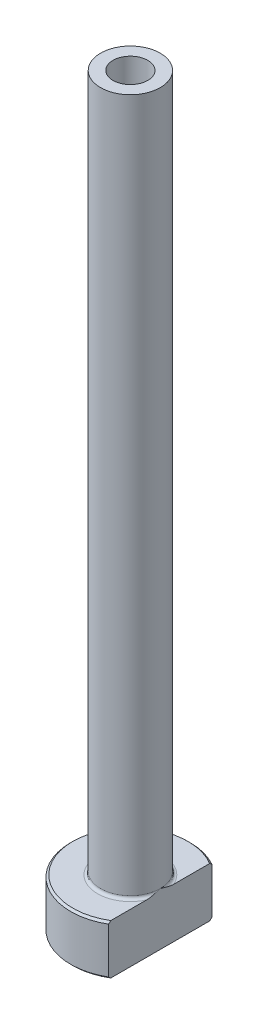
ISO-10303-21;
HEADER;
FILE_DESCRIPTION(('STEP AP214'),'2;1');
FILE_NAME('part.step','',(''),(''),'','','');
FILE_SCHEMA(('AUTOMOTIVE_DESIGN { 1 0 10303 214 1 1 1 1 }'));
ENDSEC;
DATA;
#1=APPLICATION_CONTEXT('core data for automotive mechanical design processes');
#2=APPLICATION_PROTOCOL_DEFINITION('international standard','automotive_design',2000,#1);
#3=PRODUCT_CONTEXT('',#1,'mechanical');
#4=PRODUCT('Part','Part','',(#3));
#5=PRODUCT_RELATED_PRODUCT_CATEGORY('part','',(#4));
#6=PRODUCT_DEFINITION_FORMATION('','',#4);
#7=PRODUCT_DEFINITION_CONTEXT('part definition',#1,'design');
#8=PRODUCT_DEFINITION('design','',#6,#7);
#9=PRODUCT_DEFINITION_SHAPE('','',#8);
#10=(LENGTH_UNIT() NAMED_UNIT(*) SI_UNIT(.MILLI.,.METRE.));
#11=(NAMED_UNIT(*) PLANE_ANGLE_UNIT() SI_UNIT($,.RADIAN.));
#12=(NAMED_UNIT(*) SI_UNIT($,.STERADIAN.) SOLID_ANGLE_UNIT());
#13=UNCERTAINTY_MEASURE_WITH_UNIT(LENGTH_MEASURE(1.E-05),#10,'distance_accuracy_value','');
#14=(GEOMETRIC_REPRESENTATION_CONTEXT(3) GLOBAL_UNCERTAINTY_ASSIGNED_CONTEXT((#13)) GLOBAL_UNIT_ASSIGNED_CONTEXT((#10,
#11,#12)) REPRESENTATION_CONTEXT('',''));
#15=CARTESIAN_POINT('',(0.,0.,0.));
#16=DIRECTION('',(0.,0.,1.));
#17=DIRECTION('',(1.,0.,0.));
#18=AXIS2_PLACEMENT_3D('',#15,#16,#17);
#19=CARTESIAN_POINT('',(0.,92.1876809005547,0.));
#20=DIRECTION('',(0.,1.,0.));
#21=DIRECTION('',(0.,0.,1.));
#22=AXIS2_PLACEMENT_3D('',#19,#20,#21);
#23=CYLINDRICAL_SURFACE('',#22,1.75000000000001);
#24=CARTESIAN_POINT('',(0.,75.,0.));
#25=DIRECTION('',(0.,1.,0.));
#26=DIRECTION('',(0.,0.,1.));
#27=AXIS2_PLACEMENT_3D('',#24,#25,#26);
#28=CIRCLE('',#27,1.75000000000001);
#29=CARTESIAN_POINT('',(0.,75.,1.75000000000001));
#30=VERTEX_POINT('',#29);
#31=EDGE_CURVE('E167',#30,#30,#28,.T.);
#32=ORIENTED_EDGE('',*,*,#31,.T.);
#33=EDGE_LOOP('',(#32));
#34=FACE_BOUND('',#33,.T.);
#35=CARTESIAN_POINT('',(0.,30.,0.));
#36=DIRECTION('',(0.,1.,0.));
#37=DIRECTION('',(0.,0.,1.));
#38=AXIS2_PLACEMENT_3D('',#35,#36,#37);
#39=CIRCLE('',#38,1.75000000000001);
#40=CARTESIAN_POINT('',(0.,30.,1.75000000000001));
#41=VERTEX_POINT('',#40);
#42=EDGE_CURVE('E170',#41,#41,#39,.T.);
#43=ORIENTED_EDGE('',*,*,#42,.F.);
#44=EDGE_LOOP('',(#43));
#45=FACE_BOUND('',#44,.T.);
#46=ADVANCED_FACE('F32',(#34,#45),#23,.F.);
#47=CARTESIAN_POINT('',(-1.75000000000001,75.,0.));
#48=DIRECTION('',(0.,1.,0.));
#49=DIRECTION('',(0.,0.,1.));
#50=AXIS2_PLACEMENT_3D('',#47,#48,#49);
#51=PLANE('',#50);
#52=CARTESIAN_POINT('',(0.,75.,0.));
#53=DIRECTION('',(0.,1.,0.));
#54=DIRECTION('',(0.,0.,1.));
#55=AXIS2_PLACEMENT_3D('',#52,#53,#54);
#56=CIRCLE('',#55,3.);
#57=CARTESIAN_POINT('',(0.,75.,3.));
#58=VERTEX_POINT('',#57);
#59=EDGE_CURVE('E174',#58,#58,#56,.T.);
#60=ORIENTED_EDGE('',*,*,#59,.T.);
#61=EDGE_LOOP('',(#60));
#62=FACE_BOUND('',#61,.T.);
#63=ORIENTED_EDGE('',*,*,#31,.F.);
#64=EDGE_LOOP('',(#63));
#65=FACE_BOUND('',#64,.T.);
#66=ADVANCED_FACE('F157',(#62,#65),#51,.T.);
#67=CARTESIAN_POINT('',(0.,92.1876809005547,0.));
#68=DIRECTION('',(0.,1.,0.));
#69=DIRECTION('',(0.,0.,1.));
#70=AXIS2_PLACEMENT_3D('',#67,#68,#69);
#71=CYLINDRICAL_SURFACE('',#70,2.99999999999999);
#72=CARTESIAN_POINT('',(0.,5.3,0.));
#73=DIRECTION('',(0.,1.,0.));
#74=DIRECTION('',(0.,0.,1.));
#75=AXIS2_PLACEMENT_3D('',#72,#73,#74);
#76=CIRCLE('',#75,2.99999999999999);
#77=CARTESIAN_POINT('',(2.99999999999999,5.3,0.));
#78=VERTEX_POINT('',#77);
#79=EDGE_CURVE('E180',#78,#78,#76,.T.);
#80=ORIENTED_EDGE('',*,*,#79,.T.);
#81=EDGE_LOOP('',(#80));
#82=FACE_BOUND('',#81,.T.);
#83=ORIENTED_EDGE('',*,*,#59,.F.);
#84=EDGE_LOOP('',(#83));
#85=FACE_BOUND('',#84,.T.);
#86=ADVANCED_FACE('F162',(#82,#85),#71,.T.);
#87=CARTESIAN_POINT('',(-2.99999999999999,5.,0.));
#88=DIRECTION('',(0.,1.,0.));
#89=DIRECTION('',(0.,0.,1.));
#90=AXIS2_PLACEMENT_3D('',#87,#88,#89);
#91=PLANE('',#90);
#92=DIRECTION('',(0.,0.,1.));
#93=VECTOR('',#92,1.);
#94=CARTESIAN_POINT('',(3.,5.,0.));
#95=LINE('',#94,#93);
#96=CARTESIAN_POINT('',(3.,5.,-4.96386945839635));
#97=VERTEX_POINT('',#96);
#98=CARTESIAN_POINT('',(3.,5.,-1.37477270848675));
#99=VERTEX_POINT('',#98);
#100=EDGE_CURVE('E54',#97,#99,#95,.T.);
#101=ORIENTED_EDGE('',*,*,#100,.F.);
#102=CARTESIAN_POINT('',(0.,5.,0.));
#103=DIRECTION('',(0.,1.,0.));
#104=DIRECTION('',(0.,0.,1.));
#105=AXIS2_PLACEMENT_3D('',#102,#103,#104);
#106=CIRCLE('',#105,5.80000000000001);
#107=CARTESIAN_POINT('',(2.99999999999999,5.,4.96386945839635));
#108=VERTEX_POINT('',#107);
#109=EDGE_CURVE('E186',#97,#108,#106,.T.);
#110=ORIENTED_EDGE('',*,*,#109,.T.);
#111=CARTESIAN_POINT('',(3.,5.,1.37477270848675));
#112=VERTEX_POINT('',#111);
#113=EDGE_CURVE('E134',#112,#108,#95,.T.);
#114=ORIENTED_EDGE('',*,*,#113,.F.);
#115=CARTESIAN_POINT('',(0.,5.,0.));
#116=DIRECTION('',(0.,1.,0.));
#117=DIRECTION('',(0.,0.,1.));
#118=AXIS2_PLACEMENT_3D('',#115,#116,#117);
#119=CIRCLE('',#118,3.29999999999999);
#120=EDGE_CURVE('E183',#112,#99,#119,.F.);
#121=ORIENTED_EDGE('',*,*,#120,.T.);
#122=EDGE_LOOP('',(#101,#110,#114,#121));
#123=FACE_BOUND('',#122,.T.);
#124=ADVANCED_FACE('F197',(#123),#91,.T.);
#125=CARTESIAN_POINT('',(0.,92.1876809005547,0.));
#126=DIRECTION('',(0.,1.,0.));
#127=DIRECTION('',(0.,0.,1.));
#128=AXIS2_PLACEMENT_3D('',#125,#126,#127);
#129=CYLINDRICAL_SURFACE('',#128,5.99999999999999);
#130=DIRECTION('',(0.,-1.,0.));
#131=VECTOR('',#130,1.);
#132=CARTESIAN_POINT('',(2.99999999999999,75.,5.19615242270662));
#133=LINE('',#132,#131);
#134=CARTESIAN_POINT('',(2.99999999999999,4.8,5.19615242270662));
#135=VERTEX_POINT('',#134);
#136=CARTESIAN_POINT('',(2.99999999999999,0.199999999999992,5.19615242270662));
#137=VERTEX_POINT('',#136);
#138=EDGE_CURVE('E82',#135,#137,#133,.T.);
#139=ORIENTED_EDGE('',*,*,#138,.F.);
#140=CARTESIAN_POINT('',(0.,4.8,0.));
#141=DIRECTION('',(0.,1.,0.));
#142=DIRECTION('',(0.,0.,1.));
#143=AXIS2_PLACEMENT_3D('',#140,#141,#142);
#144=CIRCLE('',#143,5.99999999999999);
#145=CARTESIAN_POINT('',(3.,4.8,-5.19615242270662));
#146=VERTEX_POINT('',#145);
#147=EDGE_CURVE('E95',#135,#146,#144,.F.);
#148=ORIENTED_EDGE('',*,*,#147,.T.);
#149=DIRECTION('',(0.,-1.,0.));
#150=VECTOR('',#149,1.);
#151=CARTESIAN_POINT('',(3.,75.,-5.19615242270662));
#152=LINE('',#151,#150);
#153=CARTESIAN_POINT('',(3.,0.199999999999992,-5.19615242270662));
#154=VERTEX_POINT('',#153);
#155=EDGE_CURVE('E192',#146,#154,#152,.T.);
#156=ORIENTED_EDGE('',*,*,#155,.T.);
#157=CARTESIAN_POINT('',(0.,0.199999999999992,0.));
#158=DIRECTION('',(0.,-1.,0.));
#159=DIRECTION('',(0.,0.,-1.));
#160=AXIS2_PLACEMENT_3D('',#157,#158,#159);
#161=CIRCLE('',#160,5.99999999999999);
#162=EDGE_CURVE('E98',#154,#137,#161,.F.);
#163=ORIENTED_EDGE('',*,*,#162,.T.);
#164=EDGE_LOOP('',(#139,#148,#156,#163));
#165=FACE_BOUND('',#164,.T.);
#166=ADVANCED_FACE('F190',(#165),#129,.T.);
#167=CARTESIAN_POINT('',(-5.99999999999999,0.,0.));
#168=DIRECTION('',(0.,-1.,0.));
#169=DIRECTION('',(0.,0.,-1.));
#170=AXIS2_PLACEMENT_3D('',#167,#168,#169);
#171=PLANE('',#170);
#172=CARTESIAN_POINT('',(0.,0.,0.));
#173=DIRECTION('',(0.,-1.,0.));
#174=DIRECTION('',(0.,0.,-1.));
#175=AXIS2_PLACEMENT_3D('',#172,#173,#174);
#176=CIRCLE('',#175,2.49999999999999);
#177=CARTESIAN_POINT('',(0.,0.,-2.49999999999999));
#178=VERTEX_POINT('',#177);
#179=EDGE_CURVE('E40',#178,#178,#176,.F.);
#180=ORIENTED_EDGE('',*,*,#179,.T.);
#181=EDGE_LOOP('',(#180));
#182=FACE_BOUND('',#181,.T.);
#183=DIRECTION('',(0.,0.,-1.));
#184=VECTOR('',#183,1.);
#185=CARTESIAN_POINT('',(2.99999999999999,0.,5.19615242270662));
#186=LINE('',#185,#184);
#187=CARTESIAN_POINT('',(2.99999999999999,0.,4.96386945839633));
#188=VERTEX_POINT('',#187);
#189=CARTESIAN_POINT('',(3.,0.,-4.96386945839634));
#190=VERTEX_POINT('',#189);
#191=EDGE_CURVE('E47',#188,#190,#186,.T.);
#192=ORIENTED_EDGE('',*,*,#191,.F.);
#193=CARTESIAN_POINT('',(0.,0.,0.));
#194=DIRECTION('',(0.,-1.,0.));
#195=DIRECTION('',(0.,0.,-1.));
#196=AXIS2_PLACEMENT_3D('',#193,#194,#195);
#197=CIRCLE('',#196,5.79999999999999);
#198=EDGE_CURVE('E92',#188,#190,#197,.T.);
#199=ORIENTED_EDGE('',*,*,#198,.T.);
#200=EDGE_LOOP('',(#192,#199));
#201=FACE_BOUND('',#200,.T.);
#202=ADVANCED_FACE('F91',(#182,#201),#171,.T.);
#203=CARTESIAN_POINT('',(0.,92.1876809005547,0.));
#204=DIRECTION('',(0.,1.,0.));
#205=DIRECTION('',(0.,0.,1.));
#206=AXIS2_PLACEMENT_3D('',#203,#204,#205);
#207=CYLINDRICAL_SURFACE('',#206,1.99999999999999);
#208=CARTESIAN_POINT('',(0.,0.5,0.));
#209=DIRECTION('',(0.,-1.,0.));
#210=DIRECTION('',(0.,0.,-1.));
#211=AXIS2_PLACEMENT_3D('',#208,#209,#210);
#212=CIRCLE('',#211,1.99999999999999);
#213=CARTESIAN_POINT('',(0.,0.5,-1.99999999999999));
#214=VERTEX_POINT('',#213);
#215=EDGE_CURVE('E11',#214,#214,#212,.T.);
#216=ORIENTED_EDGE('',*,*,#215,.T.);
#217=EDGE_LOOP('',(#216));
#218=FACE_BOUND('',#217,.T.);
#219=CARTESIAN_POINT('',(0.,18.,0.));
#220=DIRECTION('',(0.,1.,0.));
#221=DIRECTION('',(0.,0.,1.));
#222=AXIS2_PLACEMENT_3D('',#219,#220,#221);
#223=CIRCLE('',#222,1.99999999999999);
#224=CARTESIAN_POINT('',(0.,18.,1.99999999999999));
#225=VERTEX_POINT('',#224);
#226=EDGE_CURVE('E172',#225,#225,#223,.T.);
#227=ORIENTED_EDGE('',*,*,#226,.T.);
#228=EDGE_LOOP('',(#227));
#229=FACE_BOUND('',#228,.T.);
#230=ADVANCED_FACE('F215',(#218,#229),#207,.F.);
#231=CARTESIAN_POINT('',(0.,18.,0.));
#232=DIRECTION('',(0.,-1.,0.));
#233=DIRECTION('',(0.,0.,-1.));
#234=AXIS2_PLACEMENT_3D('',#231,#232,#233);
#235=CONICAL_SURFACE('',#234,1.99999999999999,0.0208303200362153);
#236=ORIENTED_EDGE('',*,*,#42,.T.);
#237=EDGE_LOOP('',(#236));
#238=FACE_BOUND('',#237,.T.);
#239=ORIENTED_EDGE('',*,*,#226,.F.);
#240=EDGE_LOOP('',(#239));
#241=FACE_BOUND('',#240,.T.);
#242=ADVANCED_FACE('F111',(#238,#241),#235,.F.);
#243=CARTESIAN_POINT('',(0.,5.3,0.));
#244=DIRECTION('',(0.,1.,0.));
#245=DIRECTION('',(0.,0.,1.));
#246=AXIS2_PLACEMENT_3D('',#243,#244,#245);
#247=TOROIDAL_SURFACE('',#246,3.29999999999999,0.3);
#248=ORIENTED_EDGE('',*,*,#120,.F.);
#249=CARTESIAN_POINT('',(2.99999999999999,5.3,0.));
#250=CARTESIAN_POINT('',(2.99999999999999,5.30000062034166,-1.12611322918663E-10));
#251=CARTESIAN_POINT('',(2.99999999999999,5.30000124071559,1.79706747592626E-07));
#252=CARTESIAN_POINT('',(2.99999999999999,5.30000241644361,7.12597407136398E-07));
#253=CARTESIAN_POINT('',(2.99999999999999,5.30000296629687,1.07470890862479E-06));
#254=CARTESIAN_POINT('',(2.99999999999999,5.30000408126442,1.93940797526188E-06));
#255=CARTESIAN_POINT('',(2.99999999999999,5.30000463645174,2.45488582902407E-06));
#256=CARTESIAN_POINT('',(2.99999999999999,5.30000565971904,3.54465510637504E-06));
#257=CARTESIAN_POINT('',(2.99999999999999,5.30000612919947,4.11770655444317E-06));
#258=CARTESIAN_POINT('',(2.99999999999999,5.30000778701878,6.25396418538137E-06));
#259=CARTESIAN_POINT('',(2.99999999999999,5.30000888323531,7.89070810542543E-06));
#260=CARTESIAN_POINT('',(2.99999999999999,5.30001076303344,1.11998048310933E-05));
#261=CARTESIAN_POINT('',(2.99999999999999,5.30001156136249,1.28642107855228E-05));
#262=CARTESIAN_POINT('',(2.99999999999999,5.3000147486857,1.96537163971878E-05));
#263=CARTESIAN_POINT('',(2.99999999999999,5.30001702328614,2.48380228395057E-05));
#264=CARTESIAN_POINT('',(2.99999999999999,5.30002052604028,3.48178470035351E-05));
#265=CARTESIAN_POINT('',(2.99999999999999,5.30002184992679,3.9580061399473E-05));
#266=CARTESIAN_POINT('',(2.99999999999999,5.30003122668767,7.41814357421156E-05));
#267=CARTESIAN_POINT('',(2.99999999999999,5.30003808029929,0.000104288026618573));
#268=CARTESIAN_POINT('',(2.99999999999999,5.30006804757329,0.00022223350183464));
#269=CARTESIAN_POINT('',(2.99999999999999,5.300096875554,0.000308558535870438));
#270=CARTESIAN_POINT('',(2.99999999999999,5.30020809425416,0.000648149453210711));
#271=CARTESIAN_POINT('',(2.99999999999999,5.30028657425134,0.000902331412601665));
#272=CARTESIAN_POINT('',(2.99999999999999,5.30059876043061,0.00190491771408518));
#273=CARTESIAN_POINT('',(2.99999999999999,5.30083723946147,0.00265218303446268));
#274=CARTESIAN_POINT('',(2.99999999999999,5.3018219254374,0.00574694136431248));
#275=CARTESIAN_POINT('',(2.99999999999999,5.30256224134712,0.00809584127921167));
#276=CARTESIAN_POINT('',(2.99999999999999,5.31160267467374,0.0367678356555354));
#277=CARTESIAN_POINT('',(2.99999999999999,5.31993817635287,0.0630827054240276));
#278=CARTESIAN_POINT('',(2.99999999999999,5.33621504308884,0.114704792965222));
#279=CARTESIAN_POINT('',(2.99999999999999,5.34415908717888,0.140011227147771));
#280=CARTESIAN_POINT('',(2.99999999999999,5.36094382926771,0.193774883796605));
#281=CARTESIAN_POINT('',(2.99999999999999,5.36977415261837,0.222235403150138));
#282=CARTESIAN_POINT('',(2.99999999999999,5.38736474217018,0.2795124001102));
#283=CARTESIAN_POINT('',(2.99999999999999,5.39612323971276,0.308329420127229));
#284=CARTESIAN_POINT('',(2.99999999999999,5.41726575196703,0.37888037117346));
#285=CARTESIAN_POINT('',(2.99999999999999,5.42952723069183,0.420651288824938));
#286=CARTESIAN_POINT('',(2.99999999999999,5.45309597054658,0.503357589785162));
#287=CARTESIAN_POINT('',(2.99999999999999,5.46441924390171,0.544288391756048));
#288=CARTESIAN_POINT('',(2.99999999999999,5.4877816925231,0.632156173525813));
#289=CARTESIAN_POINT('',(2.99999999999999,5.49969678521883,0.679126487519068));
#290=CARTESIAN_POINT('',(2.99999999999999,5.52221484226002,0.773740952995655));
#291=CARTESIAN_POINT('',(2.99999999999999,5.532807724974,0.821387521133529));
#292=CARTESIAN_POINT('',(2.99999999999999,5.55291503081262,0.92058914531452));
#293=CARTESIAN_POINT('',(2.99999999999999,5.56229188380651,0.972172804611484));
#294=CARTESIAN_POINT('',(2.99999999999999,5.57838694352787,1.07574836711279));
#295=CARTESIAN_POINT('',(2.99999999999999,5.58510535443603,1.12774023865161));
#296=CARTESIAN_POINT('',(2.99999999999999,5.59681427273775,1.24924411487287));
#297=CARTESIAN_POINT('',(2.99999999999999,5.60051317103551,1.31890364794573));
#298=CARTESIAN_POINT('',(2.99999999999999,5.59966579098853,1.42270835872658));
#299=CARTESIAN_POINT('',(2.99999999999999,5.59835823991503,1.45688093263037));
#300=CARTESIAN_POINT('',(2.99999999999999,5.59322745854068,1.52502533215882));
#301=CARTESIAN_POINT('',(2.99999999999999,5.58940645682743,1.55899730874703));
#302=CARTESIAN_POINT('',(2.99999999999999,5.57976146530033,1.61947815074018));
#303=CARTESIAN_POINT('',(2.99999999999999,5.57451506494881,1.64607760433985));
#304=CARTESIAN_POINT('',(2.99999999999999,5.56161153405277,1.69883648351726));
#305=CARTESIAN_POINT('',(2.99999999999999,5.55394338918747,1.72499331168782));
#306=CARTESIAN_POINT('',(2.99999999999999,5.53555176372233,1.77650913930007));
#307=CARTESIAN_POINT('',(2.99999999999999,5.52480031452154,1.80185836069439));
#308=CARTESIAN_POINT('',(2.99999999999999,5.49948027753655,1.85054545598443));
#309=CARTESIAN_POINT('',(2.99999999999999,5.48493141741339,1.87389291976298));
#310=CARTESIAN_POINT('',(2.99999999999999,5.45992470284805,1.9055213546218));
#311=CARTESIAN_POINT('',(2.99999999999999,5.45133318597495,1.91527363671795));
#312=CARTESIAN_POINT('',(2.99999999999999,5.43294163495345,1.93360072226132));
#313=CARTESIAN_POINT('',(2.99999999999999,5.42314083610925,1.94217477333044));
#314=CARTESIAN_POINT('',(2.99999999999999,5.40215892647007,1.95778354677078));
#315=CARTESIAN_POINT('',(2.99999999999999,5.39096156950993,1.96479687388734));
#316=CARTESIAN_POINT('',(2.99999999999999,5.36742144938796,1.97652218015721));
#317=CARTESIAN_POINT('',(2.99999999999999,5.35508207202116,1.98124071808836));
#318=CARTESIAN_POINT('',(2.99999999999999,5.33320117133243,1.98690185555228));
#319=CARTESIAN_POINT('',(2.99999999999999,5.32383559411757,1.98852953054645));
#320=CARTESIAN_POINT('',(2.99999999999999,5.30496375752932,1.99016898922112));
#321=CARTESIAN_POINT('',(2.99999999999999,5.29545756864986,1.99018155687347));
#322=CARTESIAN_POINT('',(2.99999999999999,5.27659318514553,1.98858978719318));
#323=CARTESIAN_POINT('',(2.99999999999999,5.26723486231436,1.98698693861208));
#324=CARTESIAN_POINT('',(2.99999999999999,5.24889957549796,1.98229727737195));
#325=CARTESIAN_POINT('',(2.99999999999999,5.23992286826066,1.97920948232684));
#326=CARTESIAN_POINT('',(2.99999999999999,5.21981293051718,1.97059641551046));
#327=CARTESIAN_POINT('',(2.99999999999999,5.20887713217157,1.96461176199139));
#328=CARTESIAN_POINT('',(2.99999999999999,5.18811536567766,1.95095727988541));
#329=CARTESIAN_POINT('',(2.99999999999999,5.17829177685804,1.94328393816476));
#330=CARTESIAN_POINT('',(2.99999999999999,5.15512177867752,1.92254223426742));
#331=CARTESIAN_POINT('',(2.99999999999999,5.14247568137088,1.90869680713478));
#332=CARTESIAN_POINT('',(2.99999999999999,5.11944595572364,1.87927587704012));
#333=CARTESIAN_POINT('',(2.99999999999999,5.10906527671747,1.86369815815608));
#334=CARTESIAN_POINT('',(2.99999999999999,5.08309609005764,1.81927355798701));
#335=CARTESIAN_POINT('',(2.99999999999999,5.06948546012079,1.78928084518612));
#336=CARTESIAN_POINT('',(2.99999999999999,5.04658664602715,1.7275196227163));
#337=CARTESIAN_POINT('',(2.99999999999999,5.03733582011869,1.69573828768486));
#338=CARTESIAN_POINT('',(2.99999999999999,5.02214318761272,1.63079918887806));
#339=CARTESIAN_POINT('',(2.99999999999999,5.01626537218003,1.59762686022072));
#340=CARTESIAN_POINT('',(2.99999999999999,5.0073400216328,1.53086029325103));
#341=CARTESIAN_POINT('',(2.99999999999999,5.00429797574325,1.49726536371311));
#342=CARTESIAN_POINT('',(2.99999999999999,5.00059037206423,1.43100872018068));
#343=CARTESIAN_POINT('',(2.99999999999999,4.9998534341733,1.39835069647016));
#344=CARTESIAN_POINT('',(2.99999999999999,5.0001932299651,1.3331831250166));
#345=CARTESIAN_POINT('',(2.99999999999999,5.00126261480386,1.3006735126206));
#346=CARTESIAN_POINT('',(2.99999999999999,5.00569854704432,1.22190465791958));
#347=CARTESIAN_POINT('',(2.99999999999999,5.00984986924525,1.17569031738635));
#348=CARTESIAN_POINT('',(2.99999999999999,5.0206087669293,1.08357061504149));
#349=CARTESIAN_POINT('',(2.99999999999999,5.02721586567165,1.03766519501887));
#350=CARTESIAN_POINT('',(2.99999999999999,5.0425809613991,0.945130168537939));
#351=CARTESIAN_POINT('',(2.99999999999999,5.05138514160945,0.898508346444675));
#352=CARTESIAN_POINT('',(2.99999999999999,5.07066869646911,0.805496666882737));
#353=CARTESIAN_POINT('',(2.99999999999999,5.08115218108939,0.759107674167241));
#354=CARTESIAN_POINT('',(2.99999999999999,5.10738921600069,0.650207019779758));
#355=CARTESIAN_POINT('',(2.99999999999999,5.12369110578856,0.587828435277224));
#356=CARTESIAN_POINT('',(2.99999999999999,5.15777680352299,0.464212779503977));
#357=CARTESIAN_POINT('',(2.99999999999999,5.17554263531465,0.40297066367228));
#358=CARTESIAN_POINT('',(2.99999999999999,5.21006724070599,0.287596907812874));
#359=CARTESIAN_POINT('',(2.99999999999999,5.22671796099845,0.233432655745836));
#360=CARTESIAN_POINT('',(2.99999999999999,5.2524122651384,0.150940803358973));
#361=CARTESIAN_POINT('',(2.99999999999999,5.26131063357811,0.122567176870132));
#362=CARTESIAN_POINT('',(2.99999999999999,5.27905176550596,0.0662804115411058));
#363=CARTESIAN_POINT('',(2.99999999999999,5.28789327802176,0.0383669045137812));
#364=CARTESIAN_POINT('',(2.99999999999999,5.29743877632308,0.0080925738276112));
#365=CARTESIAN_POINT('',(2.99999999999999,5.29818012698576,0.00574041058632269));
#366=CARTESIAN_POINT('',(2.99999999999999,5.29916506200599,0.00264489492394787));
#367=CARTESIAN_POINT('',(2.99999999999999,5.29940274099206,0.00190013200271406));
#368=CARTESIAN_POINT('',(2.99999999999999,5.29971394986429,0.00090068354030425));
#369=CARTESIAN_POINT('',(2.99999999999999,5.29979223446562,0.000647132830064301));
#370=CARTESIAN_POINT('',(2.99999999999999,5.29990321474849,0.000308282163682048));
#371=CARTESIAN_POINT('',(2.99999999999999,5.29993200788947,0.000222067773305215));
#372=CARTESIAN_POINT('',(2.99999999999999,5.29996194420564,0.000104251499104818));
#373=CARTESIAN_POINT('',(2.99999999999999,5.2999687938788,7.41614194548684E-05));
#374=CARTESIAN_POINT('',(2.99999999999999,5.29997816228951,3.9576667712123E-05));
#375=CARTESIAN_POINT('',(2.99999999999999,5.29997948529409,3.48154634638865E-05));
#376=CARTESIAN_POINT('',(2.99999999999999,5.29998298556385,2.48376252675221E-05));
#377=CARTESIAN_POINT('',(2.99999999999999,5.29998525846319,1.96542432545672E-05));
#378=CARTESIAN_POINT('',(2.99999999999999,5.29998844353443,1.28656642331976E-05));
#379=CARTESIAN_POINT('',(2.99999999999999,5.29998924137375,1.12013336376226E-05));
#380=CARTESIAN_POINT('',(2.99999999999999,5.29999112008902,7.89229913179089E-06));
#381=CARTESIAN_POINT('',(2.99999999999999,5.29999221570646,6.25553441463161E-06));
#382=CARTESIAN_POINT('',(2.99999999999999,5.29999387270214,4.11914308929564E-06));
#383=CARTESIAN_POINT('',(2.99999999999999,5.29999434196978,3.54603035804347E-06));
#384=CARTESIAN_POINT('',(2.99999999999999,5.29999536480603,2.45610018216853E-06));
#385=CARTESIAN_POINT('',(2.99999999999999,5.2999959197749,1.940521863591E-06));
#386=CARTESIAN_POINT('',(2.99999999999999,5.29999703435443,1.07558294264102E-06));
#387=CARTESIAN_POINT('',(2.99999999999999,5.29999758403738,7.13339211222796E-07));
#388=CARTESIAN_POINT('',(2.99999999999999,5.29999875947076,1.80121842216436E-07));
#389=CARTESIAN_POINT('',(2.99999999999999,5.29999937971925,1.12600767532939E-10));
#390=CARTESIAN_POINT('',(2.99999999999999,5.3,0.));
#391=B_SPLINE_CURVE_WITH_KNOTS('',3,(#249,#250,#251,#252,#253,#254,#255,#256,#257,#258,#259,
#260,#261,#262,#263,#264,#265,#266,#267,#268,#269,#270,#271,#272,#273,#274,#275,#276,#277,#278,
#279,#280,#281,#282,#283,#284,#285,#286,#287,#288,#289,#290,#291,#292,#293,#294,#295,#296,#297,
#298,#299,#300,#301,#302,#303,#304,#305,#306,#307,#308,#309,#310,#311,#312,#313,#314,#315,#316,
#317,#318,#319,#320,#321,#322,#323,#324,#325,#326,#327,#328,#329,#330,#331,#332,#333,#334,#335,
#336,#337,#338,#339,#340,#341,#342,#343,#344,#345,#346,#347,#348,#349,#350,#351,#352,#353,#354,
#355,#356,#357,#358,#359,#360,#361,#362,#363,#364,#365,#366,#367,#368,#369,#370,#371,#372,#373,
#374,#375,#376,#377,#378,#379,#380,#381,#382,#383,#384,#385,#386,#387,#388,#389,#390),
.UNSPECIFIED.,.T.,.F.,(4,2,2,2,2,2,2,2,2,2,2,2,2,2,2,2,2,2,2,2,2,2,2,2,2,2,2,2,2,2,2,2,2,2,2,2,
2,2,2,2,2,2,2,2,2,2,2,2,2,2,2,2,2,2,2,2,2,2,2,2,2,2,2,2,2,2,2,2,2,2,4),(0.,1.86513976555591E-06,
3.83353453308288E-06,6.09513509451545E-06,8.31560888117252E-06,1.42000739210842E-05,
1.97335549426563E-05,3.66769911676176E-05,5.14858377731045E-05,0.000144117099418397,
0.000416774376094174,0.00121521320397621,0.00356794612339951,0.0109568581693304,
0.0937636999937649,0.173336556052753,0.26273268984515,0.353088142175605,0.483684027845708,
0.611082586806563,0.756439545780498,0.902844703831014,1.06007042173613,1.21728406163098,
1.42611662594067,1.52864191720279,1.63107642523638,1.71232857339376,1.79395571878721,
1.87634808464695,1.95832065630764,1.99722769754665,2.03615946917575,2.07559591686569,
2.11491897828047,2.14330913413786,2.17168550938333,2.20003575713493,2.22840478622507,
2.26559554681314,2.30286442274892,2.35880214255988,2.4148122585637,2.51307007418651,
2.6121551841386,2.71306273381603,2.81416520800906,2.91210427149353,3.00964583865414,
3.14875779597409,3.28784276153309,3.43014232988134,3.57279564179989,3.76617940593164,
3.95746724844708,4.12746077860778,4.21667041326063,4.30450746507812,4.31190664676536,
4.31425150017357,4.3150479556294,4.31532026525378,4.31541284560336,4.31542765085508,
4.31544458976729,4.31545012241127,4.31545600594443,4.31545822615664,4.31546048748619,
4.31546245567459,4.31546432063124),.UNSPECIFIED.);
#392=EDGE_CURVE('E126',#112,#78,#391,.T.);
#393=ORIENTED_EDGE('',*,*,#392,.T.);
#394=ORIENTED_EDGE('',*,*,#79,.F.);
#395=CARTESIAN_POINT('',(2.99999999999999,5.3,0.));
#396=CARTESIAN_POINT('',(2.99999999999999,5.29999937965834,1.12611566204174E-10));
#397=CARTESIAN_POINT('',(2.99999999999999,5.29999875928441,-1.79706747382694E-07));
#398=CARTESIAN_POINT('',(2.99999999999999,5.29999758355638,-7.12597406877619E-07));
#399=CARTESIAN_POINT('',(2.99999999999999,5.29999703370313,-1.07470890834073E-06));
#400=CARTESIAN_POINT('',(2.99999999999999,5.29999591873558,-1.93940797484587E-06));
#401=CARTESIAN_POINT('',(2.99999999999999,5.29999536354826,-2.45488582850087E-06));
#402=CARTESIAN_POINT('',(2.99999999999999,5.29999434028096,-3.54465510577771E-06));
#403=CARTESIAN_POINT('',(2.99999999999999,5.29999387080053,-4.11770655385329E-06));
#404=CARTESIAN_POINT('',(2.99999999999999,5.29999221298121,-6.25396418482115E-06));
#405=CARTESIAN_POINT('',(2.99999999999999,5.29999111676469,-7.89070810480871E-06));
#406=CARTESIAN_POINT('',(2.99999999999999,5.29998923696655,-1.11998048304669E-05));
#407=CARTESIAN_POINT('',(2.99999999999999,5.2999884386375,-1.28642107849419E-05));
#408=CARTESIAN_POINT('',(2.99999999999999,5.2999852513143,-1.96537163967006E-05));
#409=CARTESIAN_POINT('',(2.99999999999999,5.29998297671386,-2.48380228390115E-05));
#410=CARTESIAN_POINT('',(2.99999999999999,5.29997947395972,-3.4817847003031E-05));
#411=CARTESIAN_POINT('',(2.99999999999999,5.29997815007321,-3.95800613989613E-05));
#412=CARTESIAN_POINT('',(2.99999999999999,5.29996877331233,-7.41814357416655E-05));
#413=CARTESIAN_POINT('',(2.99999999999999,5.2999619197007,-0.000104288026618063));
#414=CARTESIAN_POINT('',(2.99999999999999,5.29993195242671,-0.000222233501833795));
#415=CARTESIAN_POINT('',(2.99999999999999,5.299903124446,-0.000308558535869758));
#416=CARTESIAN_POINT('',(2.99999999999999,5.29979190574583,-0.000648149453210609));
#417=CARTESIAN_POINT('',(2.99999999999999,5.29971342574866,-0.000902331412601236));
#418=CARTESIAN_POINT('',(2.99999999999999,5.29940123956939,-0.00190491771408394));
#419=CARTESIAN_POINT('',(2.99999999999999,5.29916276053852,-0.00265218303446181));
#420=CARTESIAN_POINT('',(2.99999999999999,5.29817807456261,-0.00574694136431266));
#421=CARTESIAN_POINT('',(2.99999999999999,5.29743775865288,-0.00809584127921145));
#422=CARTESIAN_POINT('',(2.99999999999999,5.28839732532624,-0.036767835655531));
#423=CARTESIAN_POINT('',(2.99999999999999,5.28006182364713,-0.0630827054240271));
#424=CARTESIAN_POINT('',(2.99999999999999,5.26378495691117,-0.114704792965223));
#425=CARTESIAN_POINT('',(2.99999999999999,5.25584091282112,-0.140011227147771));
#426=CARTESIAN_POINT('',(2.99999999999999,5.23905617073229,-0.193774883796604));
#427=CARTESIAN_POINT('',(2.99999999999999,5.23022584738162,-0.222235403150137));
#428=CARTESIAN_POINT('',(2.99999999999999,5.21263525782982,-0.279512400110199));
#429=CARTESIAN_POINT('',(2.99999999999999,5.20387676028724,-0.308329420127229));
#430=CARTESIAN_POINT('',(2.99999999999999,5.18273424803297,-0.37888037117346));
#431=CARTESIAN_POINT('',(2.99999999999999,5.17047276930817,-0.420651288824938));
#432=CARTESIAN_POINT('',(2.99999999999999,5.14690402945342,-0.503357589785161));
#433=CARTESIAN_POINT('',(2.99999999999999,5.13558075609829,-0.544288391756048));
#434=CARTESIAN_POINT('',(2.99999999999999,5.1122183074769,-0.632156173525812));
#435=CARTESIAN_POINT('',(2.99999999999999,5.10030321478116,-0.679126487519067));
#436=CARTESIAN_POINT('',(2.99999999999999,5.07778515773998,-0.773740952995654));
#437=CARTESIAN_POINT('',(2.99999999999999,5.067192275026,-0.821387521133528));
#438=CARTESIAN_POINT('',(2.99999999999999,5.04708496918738,-0.920589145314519));
#439=CARTESIAN_POINT('',(2.99999999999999,5.03770811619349,-0.972172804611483));
#440=CARTESIAN_POINT('',(2.99999999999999,5.02161305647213,-1.07574836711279));
#441=CARTESIAN_POINT('',(2.99999999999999,5.01489464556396,-1.12774023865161));
#442=CARTESIAN_POINT('',(2.99999999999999,5.00318572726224,-1.24924411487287));
#443=CARTESIAN_POINT('',(2.99999999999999,4.99948682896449,-1.31890364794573));
#444=CARTESIAN_POINT('',(2.99999999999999,5.00033420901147,-1.42270835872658));
#445=CARTESIAN_POINT('',(2.99999999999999,5.00164176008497,-1.45688093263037));
#446=CARTESIAN_POINT('',(2.99999999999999,5.00677254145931,-1.52502533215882));
#447=CARTESIAN_POINT('',(2.99999999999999,5.01059354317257,-1.55899730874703));
#448=CARTESIAN_POINT('',(2.99999999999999,5.02023853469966,-1.61947815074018));
#449=CARTESIAN_POINT('',(2.99999999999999,5.02548493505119,-1.64607760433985));
#450=CARTESIAN_POINT('',(2.99999999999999,5.03838846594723,-1.69883648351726));
#451=CARTESIAN_POINT('',(2.99999999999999,5.04605661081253,-1.72499331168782));
#452=CARTESIAN_POINT('',(2.99999999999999,5.06444823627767,-1.77650913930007));
#453=CARTESIAN_POINT('',(2.99999999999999,5.07519968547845,-1.80185836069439));
#454=CARTESIAN_POINT('',(2.99999999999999,5.10051972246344,-1.85054545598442));
#455=CARTESIAN_POINT('',(2.99999999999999,5.11506858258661,-1.87389291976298));
#456=CARTESIAN_POINT('',(2.99999999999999,5.14007529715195,-1.9055213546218));
#457=CARTESIAN_POINT('',(2.99999999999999,5.14866681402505,-1.91527363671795));
#458=CARTESIAN_POINT('',(2.99999999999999,5.16705836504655,-1.93360072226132));
#459=CARTESIAN_POINT('',(2.99999999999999,5.17685916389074,-1.94217477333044));
#460=CARTESIAN_POINT('',(2.99999999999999,5.19784107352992,-1.95778354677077));
#461=CARTESIAN_POINT('',(2.99999999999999,5.20903843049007,-1.96479687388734));
#462=CARTESIAN_POINT('',(2.99999999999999,5.23257855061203,-1.97652218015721));
#463=CARTESIAN_POINT('',(2.99999999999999,5.24491792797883,-1.98124071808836));
#464=CARTESIAN_POINT('',(2.99999999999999,5.26679882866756,-1.98690185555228));
#465=CARTESIAN_POINT('',(2.99999999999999,5.27616440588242,-1.98852953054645));
#466=CARTESIAN_POINT('',(2.99999999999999,5.29503624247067,-1.99016898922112));
#467=CARTESIAN_POINT('',(2.99999999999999,5.30454243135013,-1.99018155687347));
#468=CARTESIAN_POINT('',(2.99999999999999,5.32340681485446,-1.98858978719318));
#469=CARTESIAN_POINT('',(2.99999999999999,5.33276513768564,-1.98698693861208));
#470=CARTESIAN_POINT('',(2.99999999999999,5.35110042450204,-1.98229727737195));
#471=CARTESIAN_POINT('',(2.99999999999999,5.36007713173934,-1.97920948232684));
#472=CARTESIAN_POINT('',(2.99999999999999,5.38018706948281,-1.97059641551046));
#473=CARTESIAN_POINT('',(2.99999999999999,5.39112286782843,-1.96461176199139));
#474=CARTESIAN_POINT('',(2.99999999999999,5.41188463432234,-1.95095727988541));
#475=CARTESIAN_POINT('',(2.99999999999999,5.42170822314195,-1.94328393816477));
#476=CARTESIAN_POINT('',(2.99999999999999,5.44487822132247,-1.92254223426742));
#477=CARTESIAN_POINT('',(2.99999999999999,5.45752431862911,-1.90869680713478));
#478=CARTESIAN_POINT('',(2.99999999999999,5.48055404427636,-1.87927587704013));
#479=CARTESIAN_POINT('',(2.99999999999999,5.49093472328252,-1.86369815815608));
#480=CARTESIAN_POINT('',(2.99999999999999,5.51690390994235,-1.81927355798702));
#481=CARTESIAN_POINT('',(2.99999999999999,5.53051453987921,-1.78928084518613));
#482=CARTESIAN_POINT('',(2.99999999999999,5.55341335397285,-1.72751962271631));
#483=CARTESIAN_POINT('',(2.99999999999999,5.56266417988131,-1.69573828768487));
#484=CARTESIAN_POINT('',(2.99999999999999,5.57785681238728,-1.63079918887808));
#485=CARTESIAN_POINT('',(2.99999999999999,5.58373462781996,-1.59762686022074));
#486=CARTESIAN_POINT('',(2.99999999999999,5.59265997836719,-1.53086029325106));
#487=CARTESIAN_POINT('',(2.99999999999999,5.59570202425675,-1.49726536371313));
#488=CARTESIAN_POINT('',(2.99999999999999,5.59940962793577,-1.43100872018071));
#489=CARTESIAN_POINT('',(2.99999999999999,5.6001465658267,-1.39835069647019));
#490=CARTESIAN_POINT('',(2.99999999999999,5.5998067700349,-1.33318312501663));
#491=CARTESIAN_POINT('',(2.99999999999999,5.59873738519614,-1.30067351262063));
#492=CARTESIAN_POINT('',(2.99999999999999,5.59430145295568,-1.22190465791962));
#493=CARTESIAN_POINT('',(2.99999999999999,5.59015013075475,-1.17569031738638));
#494=CARTESIAN_POINT('',(2.99999999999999,5.5793912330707,-1.08357061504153));
#495=CARTESIAN_POINT('',(2.99999999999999,5.57278413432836,-1.0376651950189));
#496=CARTESIAN_POINT('',(2.99999999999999,5.55741903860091,-0.945130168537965));
#497=CARTESIAN_POINT('',(2.99999999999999,5.54861485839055,-0.8985083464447));
#498=CARTESIAN_POINT('',(2.99999999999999,5.52933130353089,-0.805496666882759));
#499=CARTESIAN_POINT('',(2.99999999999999,5.51884781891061,-0.759107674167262));
#500=CARTESIAN_POINT('',(2.99999999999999,5.49261078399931,-0.650207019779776));
#501=CARTESIAN_POINT('',(2.99999999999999,5.47630889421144,-0.58782843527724));
#502=CARTESIAN_POINT('',(2.99999999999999,5.44222319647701,-0.464212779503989));
#503=CARTESIAN_POINT('',(2.99999999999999,5.42445736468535,-0.40297066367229));
#504=CARTESIAN_POINT('',(2.99999999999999,5.38993275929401,-0.287596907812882));
#505=CARTESIAN_POINT('',(2.99999999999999,5.37328203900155,-0.233432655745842));
#506=CARTESIAN_POINT('',(2.99999999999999,5.3475877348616,-0.150940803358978));
#507=CARTESIAN_POINT('',(2.99999999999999,5.33868936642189,-0.122567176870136));
#508=CARTESIAN_POINT('',(2.99999999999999,5.32094823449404,-0.0662804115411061));
#509=CARTESIAN_POINT('',(2.99999999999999,5.31210672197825,-0.0383669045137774));
#510=CARTESIAN_POINT('',(2.99999999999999,5.30256122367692,-0.00809257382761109));
#511=CARTESIAN_POINT('',(2.99999999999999,5.30181987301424,-0.00574041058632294));
#512=CARTESIAN_POINT('',(2.99999999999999,5.300834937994,-0.00264489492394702));
#513=CARTESIAN_POINT('',(2.99999999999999,5.30059725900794,-0.00190013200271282));
#514=CARTESIAN_POINT('',(2.99999999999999,5.30028605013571,-0.000900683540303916));
#515=CARTESIAN_POINT('',(2.99999999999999,5.30020776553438,-0.000647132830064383));
#516=CARTESIAN_POINT('',(2.99999999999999,5.30009678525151,-0.00030828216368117));
#517=CARTESIAN_POINT('',(2.99999999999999,5.30006799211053,-0.000222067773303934));
#518=CARTESIAN_POINT('',(2.99999999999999,5.30003805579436,-0.000104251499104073));
#519=CARTESIAN_POINT('',(2.99999999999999,5.3000312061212,-7.41614194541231E-05));
#520=CARTESIAN_POINT('',(2.99999999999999,5.30002183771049,-3.95766677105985E-05));
#521=CARTESIAN_POINT('',(2.99999999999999,5.30002051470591,-3.48154634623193E-05));
#522=CARTESIAN_POINT('',(2.99999999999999,5.30001701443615,-2.48376252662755E-05));
#523=CARTESIAN_POINT('',(2.99999999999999,5.30001474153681,-1.96542432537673E-05));
#524=CARTESIAN_POINT('',(2.99999999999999,5.30001155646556,-1.28656642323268E-05));
#525=CARTESIAN_POINT('',(2.99999999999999,5.30001075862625,-1.12013336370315E-05));
#526=CARTESIAN_POINT('',(2.99999999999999,5.30000887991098,-7.89229913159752E-06));
#527=CARTESIAN_POINT('',(2.99999999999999,5.30000778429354,-6.25553441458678E-06));
#528=CARTESIAN_POINT('',(2.99999999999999,5.30000612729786,-4.11914308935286E-06));
#529=CARTESIAN_POINT('',(2.99999999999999,5.30000565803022,-3.54603035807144E-06));
#530=CARTESIAN_POINT('',(2.99999999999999,5.30000463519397,-2.4561001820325E-06));
#531=CARTESIAN_POINT('',(2.99999999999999,5.3000040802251,-1.9405218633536E-06));
#532=CARTESIAN_POINT('',(2.99999999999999,5.30000296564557,-1.07558294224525E-06));
#533=CARTESIAN_POINT('',(2.99999999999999,5.30000241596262,-7.13339210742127E-07));
#534=CARTESIAN_POINT('',(2.99999999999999,5.30000124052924,-1.80121841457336E-07));
#535=CARTESIAN_POINT('',(2.99999999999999,5.30000062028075,-1.12600009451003E-10));
#536=CARTESIAN_POINT('',(2.99999999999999,5.3,0.));
#537=B_SPLINE_CURVE_WITH_KNOTS('',3,(#395,#396,#397,#398,#399,#400,#401,#402,#403,#404,#405,
#406,#407,#408,#409,#410,#411,#412,#413,#414,#415,#416,#417,#418,#419,#420,#421,#422,#423,#424,
#425,#426,#427,#428,#429,#430,#431,#432,#433,#434,#435,#436,#437,#438,#439,#440,#441,#442,#443,
#444,#445,#446,#447,#448,#449,#450,#451,#452,#453,#454,#455,#456,#457,#458,#459,#460,#461,#462,
#463,#464,#465,#466,#467,#468,#469,#470,#471,#472,#473,#474,#475,#476,#477,#478,#479,#480,#481,
#482,#483,#484,#485,#486,#487,#488,#489,#490,#491,#492,#493,#494,#495,#496,#497,#498,#499,#500,
#501,#502,#503,#504,#505,#506,#507,#508,#509,#510,#511,#512,#513,#514,#515,#516,#517,#518,#519,
#520,#521,#522,#523,#524,#525,#526,#527,#528,#529,#530,#531,#532,#533,#534,#535,#536),
.UNSPECIFIED.,.T.,.F.,(4,2,2,2,2,2,2,2,2,2,2,2,2,2,2,2,2,2,2,2,2,2,2,2,2,2,2,2,2,2,2,2,2,2,2,2,
2,2,2,2,2,2,2,2,2,2,2,2,2,2,2,2,2,2,2,2,2,2,2,2,2,2,2,2,2,2,2,2,2,2,4),(0.,1.86513976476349E-06,
3.83353453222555E-06,6.09513509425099E-06,8.31560888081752E-06,1.42000739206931E-05,
1.97335549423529E-05,3.66769911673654E-05,5.14858377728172E-05,0.00014411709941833,
0.000416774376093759,0.00121521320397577,0.0035679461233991,0.01095685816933,0.0937636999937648,
0.173336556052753,0.26273268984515,0.353088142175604,0.483684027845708,0.611082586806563,
0.756439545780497,0.902844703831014,1.06007042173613,1.21728406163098,1.42611662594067,
1.52864191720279,1.63107642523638,1.71232857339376,1.79395571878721,1.87634808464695,
1.95832065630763,1.99722769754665,2.03615946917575,2.07559591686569,2.11491897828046,
2.14330913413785,2.17168550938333,2.20003575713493,2.22840478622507,2.26559554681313,
2.30286442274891,2.35880214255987,2.41481225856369,2.5130700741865,2.61215518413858,
2.71306273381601,2.81416520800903,2.91210427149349,3.00964583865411,3.14875779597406,
3.28784276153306,3.43014232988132,3.57279564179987,3.76617940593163,3.95746724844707,
4.12746077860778,4.21667041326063,4.30450746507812,4.31190664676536,4.31425150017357,
4.31504795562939,4.31532026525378,4.31541284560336,4.31542765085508,4.31544458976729,
4.31545012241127,4.31545600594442,4.31545822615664,4.31546048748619,4.31546245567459,
4.31546432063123),.UNSPECIFIED.);
#538=EDGE_CURVE('E135',#78,#99,#537,.T.);
#539=ORIENTED_EDGE('',*,*,#538,.T.);
#540=EDGE_LOOP('',(#248,#393,#394,#539));
#541=FACE_BOUND('',#540,.T.);
#542=ADVANCED_FACE('F141',(#541),#247,.F.);
#543=CARTESIAN_POINT('',(0.,5.,0.));
#544=DIRECTION('',(0.,-1.,0.));
#545=DIRECTION('',(0.,0.,-1.));
#546=AXIS2_PLACEMENT_3D('',#543,#544,#545);
#547=CONICAL_SURFACE('',#546,5.8,0.785398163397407);
#548=CARTESIAN_POINT('',(3.,-1.01993959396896,-11.432889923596));
#549=CARTESIAN_POINT('',(3.,-0.769424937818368,-11.1738796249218));
#550=CARTESIAN_POINT('',(3.,-0.519179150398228,-10.9146084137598));
#551=CARTESIAN_POINT('',(3.,-0.0193842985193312,-10.3953890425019));
#552=CARTESIAN_POINT('',(3.,0.230164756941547,-10.1354408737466));
#553=CARTESIAN_POINT('',(3.,0.728528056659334,-9.61458602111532));
#554=CARTESIAN_POINT('',(3.,0.977341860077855,-9.353678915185));
#555=CARTESIAN_POINT('',(3.,1.47386965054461,-8.83082274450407));
#556=CARTESIAN_POINT('',(3.,1.72158364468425,-8.56887368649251));
#557=CARTESIAN_POINT('',(3.,2.21069282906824,-8.04884148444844));
#558=CARTESIAN_POINT('',(3.,2.45211594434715,-7.79078462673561));
#559=CARTESIAN_POINT('',(3.,2.93315589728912,-7.2729934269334));
#560=CARTESIAN_POINT('',(3.,3.1727727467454,-7.01325909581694));
#561=CARTESIAN_POINT('',(3.,3.64950020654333,-6.49159990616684));
#562=CARTESIAN_POINT('',(3.,3.88661134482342,-6.22967553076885));
#563=CARTESIAN_POINT('',(3.,4.35738571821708,-5.70275148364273));
#564=CARTESIAN_POINT('',(3.,4.5910490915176,-5.43775193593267));
#565=CARTESIAN_POINT('',(3.,4.96416348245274,-5.00636825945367));
#566=CARTESIAN_POINT('',(3.,5.10520133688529,-4.84135845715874));
#567=CARTESIAN_POINT('',(3.,5.38476673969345,-4.50919282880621));
#568=CARTESIAN_POINT('',(3.,5.52329404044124,-4.34203679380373));
#569=CARTESIAN_POINT('',(3.,5.79842961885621,-4.00319933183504));
#570=CARTESIAN_POINT('',(3.,5.93500216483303,-3.83148875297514));
#571=CARTESIAN_POINT('',(3.,6.20336281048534,-3.48442112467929));
#572=CARTESIAN_POINT('',(3.,6.33515205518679,-3.30906496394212));
#573=CARTESIAN_POINT('',(3.,6.59393382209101,-2.95070802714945));
#574=CARTESIAN_POINT('',(2.99999999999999,6.72082315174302,-2.76763161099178));
#575=CARTESIAN_POINT('',(2.99999999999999,6.90336321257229,-2.48771743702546));
#576=CARTESIAN_POINT('',(2.99999999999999,6.96295431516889,-2.3934539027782));
#577=CARTESIAN_POINT('',(2.99999999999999,7.07882720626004,-2.20292146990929));
#578=CARTESIAN_POINT('',(2.99999999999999,7.13510937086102,-2.10665280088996));
#579=CARTESIAN_POINT('',(2.99999999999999,7.24288059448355,-1.91297779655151));
#580=CARTESIAN_POINT('',(2.99999999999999,7.29441986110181,-1.81559978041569));
#581=CARTESIAN_POINT('',(2.99999999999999,7.3924123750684,-1.61833215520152));
#582=CARTESIAN_POINT('',(2.99999999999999,7.4388646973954,-1.51844209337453));
#583=CARTESIAN_POINT('',(2.99999999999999,7.56840030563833,-1.21511948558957));
#584=CARTESIAN_POINT('',(2.99999999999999,7.64209011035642,-1.00730397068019));
#585=CARTESIAN_POINT('',(2.99999999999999,7.72186700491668,-0.695731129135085));
#586=CARTESIAN_POINT('',(2.99999999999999,7.74302901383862,-0.595791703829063));
#587=CARTESIAN_POINT('',(2.99999999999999,7.77582528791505,-0.394325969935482));
#588=CARTESIAN_POINT('',(2.99999999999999,7.78746040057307,-0.292799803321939));
#589=CARTESIAN_POINT('',(2.99999999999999,7.80037895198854,-0.0893987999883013));
#590=CARTESIAN_POINT('',(2.99999999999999,7.80169449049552,0.0124739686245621));
#591=CARTESIAN_POINT('',(2.99999999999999,7.79396363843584,0.21582694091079));
#592=CARTESIAN_POINT('',(2.99999999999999,7.78491639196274,0.317307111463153));
#593=CARTESIAN_POINT('',(2.99999999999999,7.75721241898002,0.518039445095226));
#594=CARTESIAN_POINT('',(2.99999999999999,7.73863812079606,0.61730321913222));
#595=CARTESIAN_POINT('',(2.99999999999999,7.69303955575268,0.813850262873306));
#596=CARTESIAN_POINT('',(2.99999999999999,7.66601427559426,0.911133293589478));
#597=CARTESIAN_POINT('',(2.99999999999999,7.604644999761,1.1039484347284));
#598=CARTESIAN_POINT('',(2.99999999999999,7.57025976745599,1.19946724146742));
#599=CARTESIAN_POINT('',(2.99999999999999,7.49555762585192,1.38810736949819));
#600=CARTESIAN_POINT('',(2.99999999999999,7.45524192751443,1.48122917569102));
#601=CARTESIAN_POINT('',(2.99999999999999,7.36961028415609,1.66561491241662));
#602=CARTESIAN_POINT('',(2.99999999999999,7.32427350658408,1.75686908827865));
#603=CARTESIAN_POINT('',(2.99999999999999,7.22966073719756,1.9373213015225));
#604=CARTESIAN_POINT('',(2.99999999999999,7.18038388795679,2.02651888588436));
#605=CARTESIAN_POINT('',(2.99999999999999,7.02771106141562,2.29153460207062));
#606=CARTESIAN_POINT('',(2.99999999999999,6.91955486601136,2.4646062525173));
#607=CARTESIAN_POINT('',(2.99999999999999,6.69440299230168,2.80577028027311));
#608=CARTESIAN_POINT('',(2.99999999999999,6.57737415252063,2.97384034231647));
#609=CARTESIAN_POINT('',(2.99999999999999,6.33748949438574,3.30561771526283));
#610=CARTESIAN_POINT('',(2.99999999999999,6.21463662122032,3.46932716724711));
#611=CARTESIAN_POINT('',(2.99999999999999,5.96308085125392,3.79561670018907));
#612=CARTESIAN_POINT('',(2.99999999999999,5.83432224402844,3.95815356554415));
#613=CARTESIAN_POINT('',(2.99999999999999,5.5736136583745,4.28066737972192));
#614=CARTESIAN_POINT('',(2.99999999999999,5.44166333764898,4.44064405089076));
#615=CARTESIAN_POINT('',(2.99999999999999,5.17568445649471,4.75819552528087));
#616=CARTESIAN_POINT('',(2.99999999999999,5.04166171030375,4.91577521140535));
#617=CARTESIAN_POINT('',(2.99999999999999,4.7717623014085,5.22934053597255));
#618=CARTESIAN_POINT('',(2.99999999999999,4.63588560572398,5.38532614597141));
#619=CARTESIAN_POINT('',(2.99999999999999,4.27256222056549,5.79849838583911));
#620=CARTESIAN_POINT('',(2.99999999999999,4.04384014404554,6.05456265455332));
#621=CARTESIAN_POINT('',(2.99999999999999,3.58360020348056,6.5641703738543));
#622=CARTESIAN_POINT('',(2.99999999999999,3.35208226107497,6.81771375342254));
#623=CARTESIAN_POINT('',(2.99999999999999,2.88678846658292,7.32315936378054));
#624=CARTESIAN_POINT('',(2.99999999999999,2.65301069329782,7.57505982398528));
#625=CARTESIAN_POINT('',(2.99999999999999,2.18392232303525,8.07742926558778));
#626=CARTESIAN_POINT('',(2.99999999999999,1.94861172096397,8.32789824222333));
#627=CARTESIAN_POINT('',(2.99999999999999,1.48651581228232,8.81743943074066));
#628=CARTESIAN_POINT('',(2.99999999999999,1.25977806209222,9.05655656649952));
#629=CARTESIAN_POINT('',(2.99999999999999,0.80543969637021,9.53397105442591));
#630=CARTESIAN_POINT('',(2.99999999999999,0.577839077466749,9.77226840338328));
#631=CARTESIAN_POINT('',(2.99999999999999,0.12219807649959,10.2479325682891));
#632=CARTESIAN_POINT('',(2.99999999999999,-0.105841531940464,10.4853001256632));
#633=CARTESIAN_POINT('',(2.99999999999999,-0.562491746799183,10.9594816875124));
#634=CARTESIAN_POINT('',(2.99999999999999,-0.791102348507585,11.1962956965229));
#635=CARTESIAN_POINT('',(2.99999999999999,-1.01993959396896,11.432889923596));
#636=B_SPLINE_CURVE_WITH_KNOTS('',3,(#548,#549,#550,#551,#552,#553,#554,#555,#556,#557,#558,
#559,#560,#561,#562,#563,#564,#565,#566,#567,#568,#569,#570,#571,#572,#573,#574,#575,#576,#577,
#578,#579,#580,#581,#582,#583,#584,#585,#586,#587,#588,#589,#590,#591,#592,#593,#594,#595,#596,
#597,#598,#599,#600,#601,#602,#603,#604,#605,#606,#607,#608,#609,#610,#611,#612,#613,#614,#615,
#616,#617,#618,#619,#620,#621,#622,#623,#624,#625,#626,#627,#628,#629,#630,#631,#632,#633,#634,
#635),.UNSPECIFIED.,.F.,.F.,(4,2,2,2,2,2,2,2,2,2,2,2,2,2,2,2,2,2,2,2,2,2,2,2,2,2,2,2,2,2,2,2,2,
2,2,2,2,2,2,2,2,2,2,4),(0.,1.08101662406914,2.16204714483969,3.24363027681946,4.32520642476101,
5.38534462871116,6.445475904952,7.50537917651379,8.56523985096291,9.21643479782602,
9.86769362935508,10.52583232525,11.183812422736,11.8517813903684,12.1862877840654,
12.5207560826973,12.85113322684,13.1815703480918,13.839916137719,14.1460077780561,
14.4520721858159,14.7571841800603,15.0623213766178,15.3648619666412,15.6674388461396,
15.971757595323,16.2760142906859,16.5815843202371,16.88722102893,17.4990577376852,
18.1133060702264,18.7272470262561,19.3492675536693,19.971355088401,20.5919343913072,
21.212524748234,22.2425132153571,23.2725306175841,24.3035181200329,25.3345090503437,
26.3230827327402,27.31166028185,28.2991352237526,29.286602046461),.UNSPECIFIED.);
#637=EDGE_CURVE('E133',#146,#97,#636,.T.);
#638=ORIENTED_EDGE('',*,*,#637,.F.);
#639=ORIENTED_EDGE('',*,*,#147,.F.);
#640=EDGE_CURVE('E118',#108,#135,#636,.T.);
#641=ORIENTED_EDGE('',*,*,#640,.F.);
#642=ORIENTED_EDGE('',*,*,#109,.F.);
#643=EDGE_LOOP('',(#638,#639,#641,#642));
#644=FACE_BOUND('',#643,.T.);
#645=ADVANCED_FACE('F145',(#644),#547,.T.);
#646=CARTESIAN_POINT('',(0.,0.199999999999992,0.));
#647=DIRECTION('',(0.,1.,0.));
#648=DIRECTION('',(0.,0.,1.));
#649=AXIS2_PLACEMENT_3D('',#646,#647,#648);
#650=CONICAL_SURFACE('',#649,5.99999999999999,0.785398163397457);
#651=CARTESIAN_POINT('',(2.99999999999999,6.01993959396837,11.432889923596));
#652=CARTESIAN_POINT('',(2.99999999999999,5.76942493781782,11.1738796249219));
#653=CARTESIAN_POINT('',(2.99999999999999,5.51917915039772,10.9146084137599));
#654=CARTESIAN_POINT('',(2.99999999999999,5.01938429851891,10.395389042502));
#655=CARTESIAN_POINT('',(2.99999999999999,4.76983524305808,10.1354408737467));
#656=CARTESIAN_POINT('',(2.99999999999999,4.27147194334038,9.61458602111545));
#657=CARTESIAN_POINT('',(2.99999999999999,4.0226581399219,9.35367891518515));
#658=CARTESIAN_POINT('',(2.99999999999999,3.52613034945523,8.83082274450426));
#659=CARTESIAN_POINT('',(2.99999999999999,3.27841635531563,8.56887368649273));
#660=CARTESIAN_POINT('',(2.99999999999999,2.78930717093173,8.04884148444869));
#661=CARTESIAN_POINT('',(2.99999999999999,2.54788405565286,7.79078462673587));
#662=CARTESIAN_POINT('',(2.99999999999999,2.06684410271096,7.2729934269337));
#663=CARTESIAN_POINT('',(2.99999999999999,1.82722725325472,7.01325909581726));
#664=CARTESIAN_POINT('',(2.99999999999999,1.35049979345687,6.4915999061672));
#665=CARTESIAN_POINT('',(2.99999999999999,1.11338865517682,6.22967553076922));
#666=CARTESIAN_POINT('',(2.99999999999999,0.642614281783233,5.70275148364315));
#667=CARTESIAN_POINT('',(2.99999999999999,0.408950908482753,5.43775193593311));
#668=CARTESIAN_POINT('',(2.99999999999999,0.035836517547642,5.00636825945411));
#669=CARTESIAN_POINT('',(2.99999999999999,-0.105201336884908,4.84135845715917));
#670=CARTESIAN_POINT('',(2.99999999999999,-0.384766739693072,4.50919282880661));
#671=CARTESIAN_POINT('',(2.99999999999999,-0.523294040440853,4.34203679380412));
#672=CARTESIAN_POINT('',(2.99999999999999,-0.798429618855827,4.00319933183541));
#673=CARTESIAN_POINT('',(2.99999999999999,-0.935002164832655,3.83148875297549));
#674=CARTESIAN_POINT('',(2.99999999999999,-1.20336281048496,3.48442112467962));
#675=CARTESIAN_POINT('',(2.99999999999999,-1.33515205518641,3.30906496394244));
#676=CARTESIAN_POINT('',(2.99999999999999,-1.59393382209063,2.95070802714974));
#677=CARTESIAN_POINT('',(2.99999999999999,-1.72082315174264,2.76763161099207));
#678=CARTESIAN_POINT('',(2.99999999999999,-1.90336321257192,2.48771743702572));
#679=CARTESIAN_POINT('',(2.99999999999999,-1.96295431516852,2.39345390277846));
#680=CARTESIAN_POINT('',(2.99999999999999,-2.07882720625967,2.20292146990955));
#681=CARTESIAN_POINT('',(2.99999999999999,-2.13510937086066,2.10665280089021));
#682=CARTESIAN_POINT('',(2.99999999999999,-2.24288059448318,1.91297779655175));
#683=CARTESIAN_POINT('',(2.99999999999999,-2.29441986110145,1.81559978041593));
#684=CARTESIAN_POINT('',(2.99999999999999,-2.39241237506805,1.61833215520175));
#685=CARTESIAN_POINT('',(2.99999999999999,-2.43886469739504,1.51844209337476));
#686=CARTESIAN_POINT('',(2.99999999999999,-2.56840030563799,1.21511948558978));
#687=CARTESIAN_POINT('',(2.99999999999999,-2.64209011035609,1.00730397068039));
#688=CARTESIAN_POINT('',(2.99999999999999,-2.72186700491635,0.695731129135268));
#689=CARTESIAN_POINT('',(2.99999999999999,-2.74302901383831,0.595791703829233));
#690=CARTESIAN_POINT('',(2.99999999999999,-2.77582528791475,0.394325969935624));
#691=CARTESIAN_POINT('',(2.99999999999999,-2.78746040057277,0.292799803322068));
#692=CARTESIAN_POINT('',(2.99999999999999,-2.80037895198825,0.0893987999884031));
#693=CARTESIAN_POINT('',(2.99999999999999,-2.80169449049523,-0.0124739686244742));
#694=CARTESIAN_POINT('',(2.99999999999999,-2.79396363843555,-0.21582694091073));
#695=CARTESIAN_POINT('',(2.99999999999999,-2.78491639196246,-0.317307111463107));
#696=CARTESIAN_POINT('',(2.99999999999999,-2.75721241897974,-0.518039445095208));
#697=CARTESIAN_POINT('',(2.99999999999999,-2.73863812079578,-0.617303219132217));
#698=CARTESIAN_POINT('',(2.99999999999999,-2.69303955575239,-0.813850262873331));
#699=CARTESIAN_POINT('',(2.99999999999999,-2.66601427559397,-0.911133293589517));
#700=CARTESIAN_POINT('',(2.99999999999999,-2.60464499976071,-1.10394843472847));
#701=CARTESIAN_POINT('',(2.99999999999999,-2.57025976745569,-1.19946724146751));
#702=CARTESIAN_POINT('',(2.99999999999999,-2.49555762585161,-1.3881073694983));
#703=CARTESIAN_POINT('',(2.99999999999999,-2.45524192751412,-1.48122917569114));
#704=CARTESIAN_POINT('',(2.99999999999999,-2.36961028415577,-1.66561491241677));
#705=CARTESIAN_POINT('',(2.99999999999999,-2.32427350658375,-1.75686908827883));
#706=CARTESIAN_POINT('',(2.99999999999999,-2.22966073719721,-1.93732130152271));
#707=CARTESIAN_POINT('',(2.99999999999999,-2.18038388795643,-2.0265188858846));
#708=CARTESIAN_POINT('',(2.99999999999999,-2.02771106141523,-2.29153460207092));
#709=CARTESIAN_POINT('',(3.,-1.91955486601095,-2.46460625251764));
#710=CARTESIAN_POINT('',(3.,-1.69440299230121,-2.80577028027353));
#711=CARTESIAN_POINT('',(3.,-1.57737415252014,-2.97384034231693));
#712=CARTESIAN_POINT('',(3.,-1.33748949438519,-3.30561771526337));
#713=CARTESIAN_POINT('',(3.,-1.21463662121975,-3.4693271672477));
#714=CARTESIAN_POINT('',(3.,-0.963080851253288,-3.79561670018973));
#715=CARTESIAN_POINT('',(3.,-0.834322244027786,-3.95815356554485));
#716=CARTESIAN_POINT('',(3.,-0.573613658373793,-4.2806673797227));
#717=CARTESIAN_POINT('',(3.,-0.441663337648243,-4.44064405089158));
#718=CARTESIAN_POINT('',(3.,-0.175684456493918,-4.75819552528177));
#719=CARTESIAN_POINT('',(3.,-0.0416617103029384,-4.91577521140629));
#720=CARTESIAN_POINT('',(3.,0.22823769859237,-5.22934053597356));
#721=CARTESIAN_POINT('',(3.,0.364114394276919,-5.38532614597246));
#722=CARTESIAN_POINT('',(3.,0.727437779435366,-5.79849838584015));
#723=CARTESIAN_POINT('',(3.,0.956159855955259,-6.0545626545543));
#724=CARTESIAN_POINT('',(3.,1.41639979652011,-6.56417037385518));
#725=CARTESIAN_POINT('',(3.,1.64791773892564,-6.81771375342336));
#726=CARTESIAN_POINT('',(3.,2.11321153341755,-7.32315936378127));
#727=CARTESIAN_POINT('',(3.,2.34698930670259,-7.57505982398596));
#728=CARTESIAN_POINT('',(3.,2.81607767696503,-8.07742926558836));
#729=CARTESIAN_POINT('',(3.,3.05138827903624,-8.32789824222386));
#730=CARTESIAN_POINT('',(3.,3.51348418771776,-8.81743943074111));
#731=CARTESIAN_POINT('',(3.,3.7402219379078,-9.05655656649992));
#732=CARTESIAN_POINT('',(3.,4.19456030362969,-9.53397105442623));
#733=CARTESIAN_POINT('',(3.,4.42216092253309,-9.77226840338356));
#734=CARTESIAN_POINT('',(3.,4.87780192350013,-10.2479325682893));
#735=CARTESIAN_POINT('',(3.,5.10584153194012,-10.4853001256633));
#736=CARTESIAN_POINT('',(3.,5.56249174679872,-10.9594816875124));
#737=CARTESIAN_POINT('',(3.,5.79110234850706,-11.1962956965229));
#738=CARTESIAN_POINT('',(3.,6.01993959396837,-11.432889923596));
#739=B_SPLINE_CURVE_WITH_KNOTS('',3,(#651,#652,#653,#654,#655,#656,#657,#658,#659,#660,#661,
#662,#663,#664,#665,#666,#667,#668,#669,#670,#671,#672,#673,#674,#675,#676,#677,#678,#679,#680,
#681,#682,#683,#684,#685,#686,#687,#688,#689,#690,#691,#692,#693,#694,#695,#696,#697,#698,#699,
#700,#701,#702,#703,#704,#705,#706,#707,#708,#709,#710,#711,#712,#713,#714,#715,#716,#717,#718,
#719,#720,#721,#722,#723,#724,#725,#726,#727,#728,#729,#730,#731,#732,#733,#734,#735,#736,#737,
#738),.UNSPECIFIED.,.F.,.F.,(4,2,2,2,2,2,2,2,2,2,2,2,2,2,2,2,2,2,2,2,2,2,2,2,2,2,2,2,2,2,2,2,2,
2,2,2,2,2,2,2,2,2,2,4),(0.,1.08101662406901,2.16204714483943,3.24363027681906,4.32520642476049,
5.38534462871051,6.44547590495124,7.50537917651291,8.56523985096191,9.21643479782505,
9.86769362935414,10.5258323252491,11.1838124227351,11.8517813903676,12.1862877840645,
12.5207560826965,12.8511332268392,13.181570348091,13.8399161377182,14.1460077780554,
14.4520721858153,14.7571841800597,15.0623213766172,15.3648619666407,15.6674388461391,
15.9717575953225,16.2760142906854,16.5815843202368,16.8872210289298,17.4990577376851,
18.1133060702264,18.7272470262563,19.3492675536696,19.9713550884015,20.5919343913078,
21.2125247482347,22.2425132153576,23.2725306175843,24.3035181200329,25.3345090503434,
26.3230827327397,27.3116602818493,28.2991352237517,29.2866020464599),.UNSPECIFIED.);
#740=EDGE_CURVE('E79',#137,#188,#739,.T.);
#741=ORIENTED_EDGE('',*,*,#740,.F.);
#742=ORIENTED_EDGE('',*,*,#162,.F.);
#743=EDGE_CURVE('E87',#190,#154,#739,.T.);
#744=ORIENTED_EDGE('',*,*,#743,.F.);
#745=ORIENTED_EDGE('',*,*,#198,.F.);
#746=EDGE_LOOP('',(#741,#742,#744,#745));
#747=FACE_BOUND('',#746,.T.);
#748=ADVANCED_FACE('F94',(#747),#650,.T.);
#749=CARTESIAN_POINT('',(2.99999999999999,75.,5.19615242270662));
#750=DIRECTION('',(-1.,0.,0.));
#751=DIRECTION('',(0.,0.,1.));
#752=AXIS2_PLACEMENT_3D('',#749,#750,#751);
#753=PLANE('',#752);
#754=ORIENTED_EDGE('',*,*,#392,.F.);
#755=ORIENTED_EDGE('',*,*,#113,.T.);
#756=ORIENTED_EDGE('',*,*,#640,.T.);
#757=ORIENTED_EDGE('',*,*,#138,.T.);
#758=ORIENTED_EDGE('',*,*,#740,.T.);
#759=ORIENTED_EDGE('',*,*,#191,.T.);
#760=ORIENTED_EDGE('',*,*,#743,.T.);
#761=ORIENTED_EDGE('',*,*,#155,.F.);
#762=ORIENTED_EDGE('',*,*,#637,.T.);
#763=ORIENTED_EDGE('',*,*,#100,.T.);
#764=ORIENTED_EDGE('',*,*,#538,.F.);
#765=EDGE_LOOP('',(#754,#755,#756,#757,#758,#759,#760,#761,#762,#763,#764));
#766=FACE_BOUND('',#765,.T.);
#767=ADVANCED_FACE('F80',(#766),#753,.F.);
#768=CARTESIAN_POINT('',(0.,0.,0.));
#769=DIRECTION('',(0.,-1.,0.));
#770=DIRECTION('',(0.,0.,-1.));
#771=AXIS2_PLACEMENT_3D('',#768,#769,#770);
#772=CONICAL_SURFACE('',#771,2.49999999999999,0.785398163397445);
#773=ORIENTED_EDGE('',*,*,#215,.F.);
#774=EDGE_LOOP('',(#773));
#775=FACE_BOUND('',#774,.T.);
#776=ORIENTED_EDGE('',*,*,#179,.F.);
#777=EDGE_LOOP('',(#776));
#778=FACE_BOUND('',#777,.T.);
#779=ADVANCED_FACE('F34',(#775,#778),#772,.F.);
#780=CLOSED_SHELL('',(#46,#66,#86,#124,#166,#202,#230,#242,#542,#645,#748,#767,#779));
#781=MANIFOLD_SOLID_BREP('B2',#780);
#782=ADVANCED_BREP_SHAPE_REPRESENTATION('',(#18,#781),#14);
#783=SHAPE_DEFINITION_REPRESENTATION(#9,#782);
ENDSEC;
END-ISO-10303-21;
